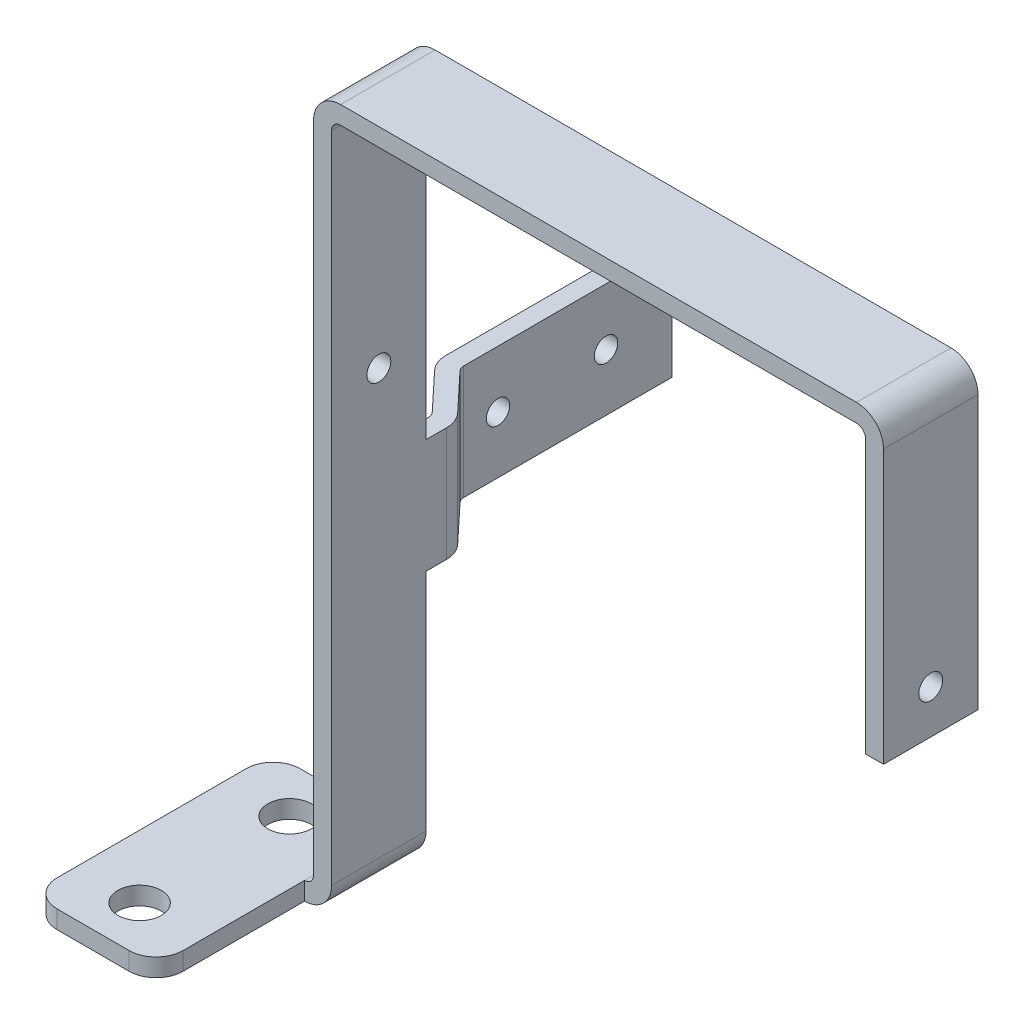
from build123d import *

# Parameters (mm, degrees)
EXTRUDE_THIN1_DEPTH = 4.0005
EXTRUDE_THIN2_DEPTH = 9.652
SKETCH6_R           = 0.9906
CUT_EXTRUDE3_DEPTH  = 69.73671885
FILLET1_R           = 0.762
FILLET2_R           = 2.286
SKETCH2_W           = 10.668
SKETCH2_H           = 20.574
BOSS_EXTRUDE1_DEPTH = 1.524
SKETCH3_R           = 1.8415
CUT_EXTRUDE1_DEPTH  = 75.145624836
FILLET3_R           = 2.286
SKETCH4_R           = 1.016
CUT_EXTRUDE2_DEPTH  = 75.674947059


with BuildPart() as part:
    # Sketch1 → Extrude-Thin1 (new, symmetric)
    with BuildSketch(Plane.XY):
        Polygon((-35.56, -33.02), (-24.13, -33.02), (-24.13, 0), (-24.13, 25.4), (0, 25.4), (24.13, 25.4), (24.13, 0), (22.606, 0), (22.606, 23.876), (0, 23.876), (-22.606, 23.876), (-22.606, 0), (-22.606, -34.544), (-35.56, -34.544), align=None)
    extrude(amount=EXTRUDE_THIN1_DEPTH, both=True)

    # Sketch5 → Extrude-Thin2 (add)
    with BuildSketch(Plane(origin=(0, -3.556, 0), x_dir=(1, 0, 0), z_dir=(0, 1, 0))):
        Polygon((-24.13, 4.0005), (-24.13, 6.0325), (-27.94, 10.0965), (-27.94, 28.6385), (-26.416, 28.6385), (-26.416, 10.699161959), (-22.606, 6.635161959), (-22.606, 4.0005), align=None)
    extrude(amount=-EXTRUDE_THIN2_DEPTH)

    # Sketch6 → Cut-Extrude3 (cut, through all)
    with BuildSketch(Plane.ZY.offset(27.94)):
        with Locations(Location((-23.0505, -8.382, 0), (0, 0, 270))):
            Circle(SKETCH6_R)
        with Locations(Location((-13.9065, -8.382, 0), (0, 0, 270))):
            Circle(SKETCH6_R)
    extrude(amount=-CUT_EXTRUDE3_DEPTH, mode=Mode.SUBTRACT)

    # Fillet1
    fillet1_edges = [part.edges().sort_by_distance(p)[0] for p in [
        (22.606, 23.876, 0),
        (-22.606, 23.876, 0),
        (-24.13, -33.02, 0),
        (-26.416, -8.382, -10.699161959),
        (-24.13, -8.382, -6.0325),
    ]]
    fillet(fillet1_edges, radius=FILLET1_R)

    # Fillet2
    fillet2_edges = [part.edges().sort_by_distance(p)[0] for p in [
        (24.13, 25.4, 0),
        (-24.13, 25.4, 0),
        (-22.606, -34.544, 0),
        (-27.94, -8.382, -10.0965),
        (-22.606, -8.382, -6.635161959),
    ]]
    fillet(fillet2_edges, radius=FILLET2_R)

    # Sketch2 → Boss-Extrude1 (add)
    with BuildSketch(Plane(origin=(0, -33.02, 0), x_dir=(1, 0, 0), z_dir=(0, 1, 0))):
        with Locations((-30.226, -6.2865)):
            Rectangle(SKETCH2_W, SKETCH2_H)
    extrude(amount=-BOSS_EXTRUDE1_DEPTH)

    # Sketch3 → Cut-Extrude1 (cut, through all)
    with BuildSketch(Plane(origin=(0, -33.02, 0), x_dir=(1, 0, 0), z_dir=(0, 1, 0))):
        with Locations(Location((-30.226, 0.0635, 0), (0, 0, 180))):
            Circle(SKETCH3_R)
        with Locations((-30.226, -12.6365)):
            Circle(SKETCH3_R)
    extrude(amount=-CUT_EXTRUDE1_DEPTH, mode=Mode.SUBTRACT)

    # Fillet3
    fillet3_edges = [part.edges().sort_by_distance(p)[0] for p in [
        (-35.56, -33.782, 16.5735),
        (-24.892, -33.782, 16.5735),
        (-35.56, -33.782, -4.0005),
    ]]
    fillet(fillet3_edges, radius=FILLET3_R)

    # Sketch4 → Cut-Extrude2 (cut, through all)
    with BuildSketch(Plane(origin=(24.13, 0, 0), x_dir=(0, 0, -1), z_dir=(1, 0, 0))):
        with Locations(Location((0, 3.683, 0), (0, 0, 90))):
            Circle(SKETCH4_R)
    extrude(amount=-CUT_EXTRUDE2_DEPTH, mode=Mode.SUBTRACT)


solid = part.part
